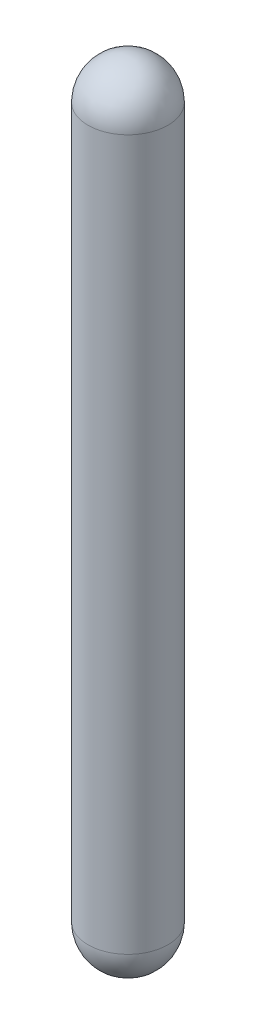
ISO-10303-21;
HEADER;
FILE_DESCRIPTION(('STEP AP214'),'2;1');
FILE_NAME('part.step','',(''),(''),'','','');
FILE_SCHEMA(('AUTOMOTIVE_DESIGN { 1 0 10303 214 1 1 1 1 }'));
ENDSEC;
DATA;
#1=APPLICATION_CONTEXT('core data for automotive mechanical design processes');
#2=APPLICATION_PROTOCOL_DEFINITION('international standard','automotive_design',2000,#1);
#3=PRODUCT_CONTEXT('',#1,'mechanical');
#4=PRODUCT('Part','Part','',(#3));
#5=PRODUCT_RELATED_PRODUCT_CATEGORY('part','',(#4));
#6=PRODUCT_DEFINITION_FORMATION('','',#4);
#7=PRODUCT_DEFINITION_CONTEXT('part definition',#1,'design');
#8=PRODUCT_DEFINITION('design','',#6,#7);
#9=PRODUCT_DEFINITION_SHAPE('','',#8);
#10=(LENGTH_UNIT() NAMED_UNIT(*) SI_UNIT(.MILLI.,.METRE.));
#11=(NAMED_UNIT(*) PLANE_ANGLE_UNIT() SI_UNIT($,.RADIAN.));
#12=(NAMED_UNIT(*) SI_UNIT($,.STERADIAN.) SOLID_ANGLE_UNIT());
#13=UNCERTAINTY_MEASURE_WITH_UNIT(LENGTH_MEASURE(1.E-05),#10,'distance_accuracy_value','');
#14=(GEOMETRIC_REPRESENTATION_CONTEXT(3) GLOBAL_UNCERTAINTY_ASSIGNED_CONTEXT((#13)) GLOBAL_UNIT_ASSIGNED_CONTEXT((#10,
#11,#12)) REPRESENTATION_CONTEXT('',''));
#15=CARTESIAN_POINT('',(0.,0.,0.));
#16=DIRECTION('',(0.,0.,1.));
#17=DIRECTION('',(1.,0.,0.));
#18=AXIS2_PLACEMENT_3D('',#15,#16,#17);
#19=CARTESIAN_POINT('',(0.,40.,0.));
#20=DIRECTION('',(0.,-1.,0.));
#21=DIRECTION('',(0.,0.,-1.));
#22=AXIS2_PLACEMENT_3D('',#19,#20,#21);
#23=CYLINDRICAL_SURFACE('',#22,2.25);
#24=CARTESIAN_POINT('',(0.,40.,0.));
#25=DIRECTION('',(0.,1.,0.));
#26=DIRECTION('',(0.,0.,1.));
#27=AXIS2_PLACEMENT_3D('',#24,#25,#26);
#28=CIRCLE('',#27,2.25);
#29=CARTESIAN_POINT('',(0.,40.,2.25));
#30=VERTEX_POINT('',#29);
#31=EDGE_CURVE('E10',#30,#30,#28,.T.);
#32=ORIENTED_EDGE('',*,*,#31,.F.);
#33=EDGE_LOOP('',(#32));
#34=FACE_BOUND('',#33,.T.);
#35=CARTESIAN_POINT('',(0.,0.,0.));
#36=DIRECTION('',(0.,1.,0.));
#37=DIRECTION('',(0.,0.,1.));
#38=AXIS2_PLACEMENT_3D('',#35,#36,#37);
#39=CIRCLE('',#38,2.25);
#40=CARTESIAN_POINT('',(0.,0.,2.25));
#41=VERTEX_POINT('',#40);
#42=EDGE_CURVE('E33',#41,#41,#39,.T.);
#43=ORIENTED_EDGE('',*,*,#42,.T.);
#44=EDGE_LOOP('',(#43));
#45=FACE_BOUND('',#44,.T.);
#46=ADVANCED_FACE('F29',(#34,#45),#23,.T.);
#47=CARTESIAN_POINT('',(0.,40.,0.));
#48=DIRECTION('',(0.,0.,1.));
#49=DIRECTION('',(1.,0.,0.));
#50=AXIS2_PLACEMENT_3D('',#47,#48,#49);
#51=SPHERICAL_SURFACE('',#50,2.25);
#52=CARTESIAN_POINT('',(0.,40.,0.));
#53=DIRECTION('',(0.,1.,0.));
#54=DIRECTION('',(0.,0.,1.));
#55=AXIS2_PLACEMENT_3D('',#52,#53,#54);
#56=SPHERICAL_SURFACE('',#55,2.25);
#57=ORIENTED_EDGE('',*,*,#31,.T.);
#58=EDGE_LOOP('',(#57));
#59=FACE_BOUND('',#58,.T.);
#60=ADVANCED_FACE('F44',(#59),#56,.T.);
#61=CARTESIAN_POINT('',(0.,0.,0.));
#62=DIRECTION('',(0.,0.,1.));
#63=DIRECTION('',(1.,0.,0.));
#64=AXIS2_PLACEMENT_3D('',#61,#62,#63);
#65=SPHERICAL_SURFACE('',#64,2.25);
#66=CARTESIAN_POINT('',(0.,0.,0.));
#67=DIRECTION('',(0.,1.,0.));
#68=DIRECTION('',(0.,0.,1.));
#69=AXIS2_PLACEMENT_3D('',#66,#67,#68);
#70=SPHERICAL_SURFACE('',#69,2.25);
#71=ORIENTED_EDGE('',*,*,#42,.F.);
#72=EDGE_LOOP('',(#71));
#73=FACE_BOUND('',#72,.T.);
#74=ADVANCED_FACE('F31',(#73),#70,.T.);
#75=CLOSED_SHELL('',(#46,#60,#74));
#76=MANIFOLD_SOLID_BREP('B2',#75);
#77=ADVANCED_BREP_SHAPE_REPRESENTATION('',(#18,#76),#14);
#78=SHAPE_DEFINITION_REPRESENTATION(#9,#77);
ENDSEC;
END-ISO-10303-21;
